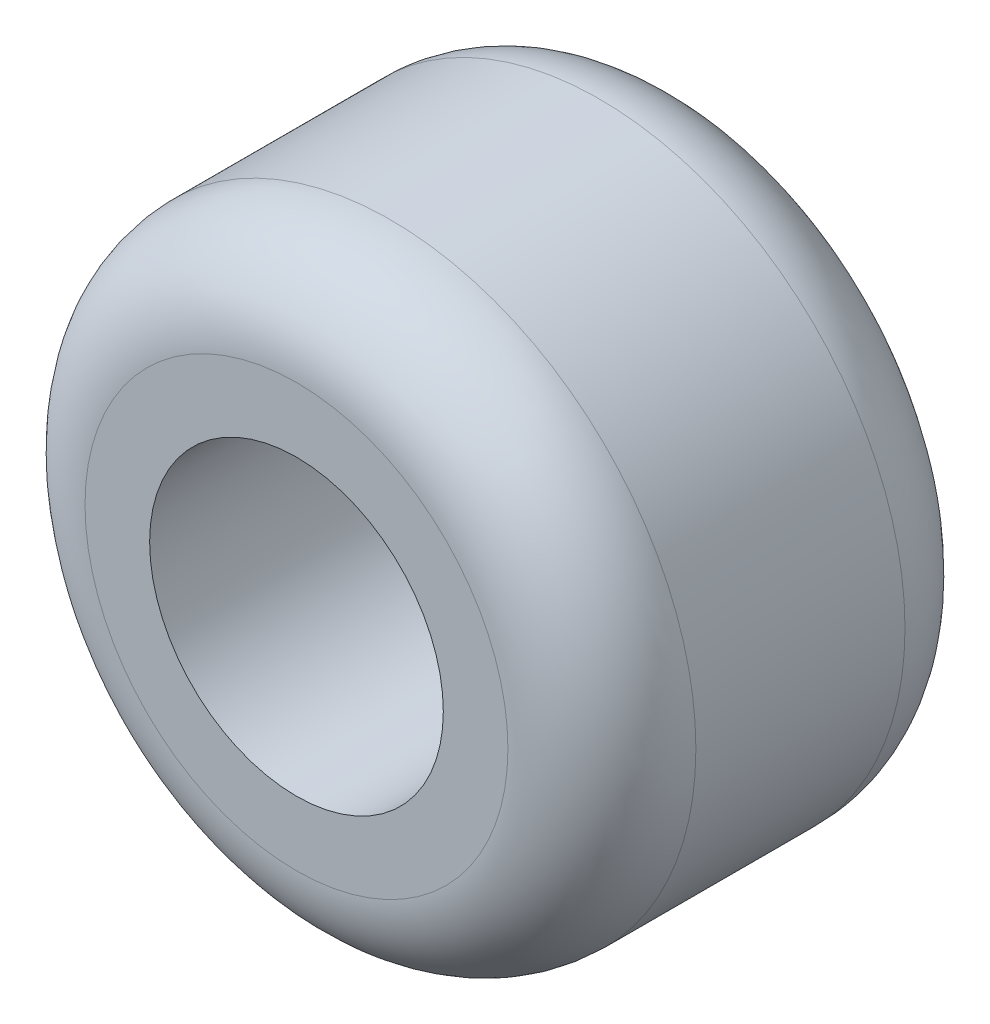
ISO-10303-21;
HEADER;
FILE_DESCRIPTION(('STEP AP214'),'2;1');
FILE_NAME('part.step','',(''),(''),'','','');
FILE_SCHEMA(('AUTOMOTIVE_DESIGN { 1 0 10303 214 1 1 1 1 }'));
ENDSEC;
DATA;
#1=APPLICATION_CONTEXT('core data for automotive mechanical design processes');
#2=APPLICATION_PROTOCOL_DEFINITION('international standard','automotive_design',2000,#1);
#3=PRODUCT_CONTEXT('',#1,'mechanical');
#4=PRODUCT('Part','Part','',(#3));
#5=PRODUCT_RELATED_PRODUCT_CATEGORY('part','',(#4));
#6=PRODUCT_DEFINITION_FORMATION('','',#4);
#7=PRODUCT_DEFINITION_CONTEXT('part definition',#1,'design');
#8=PRODUCT_DEFINITION('design','',#6,#7);
#9=PRODUCT_DEFINITION_SHAPE('','',#8);
#10=(LENGTH_UNIT() NAMED_UNIT(*) SI_UNIT(.MILLI.,.METRE.));
#11=(NAMED_UNIT(*) PLANE_ANGLE_UNIT() SI_UNIT($,.RADIAN.));
#12=(NAMED_UNIT(*) SI_UNIT($,.STERADIAN.) SOLID_ANGLE_UNIT());
#13=UNCERTAINTY_MEASURE_WITH_UNIT(LENGTH_MEASURE(1.E-05),#10,'distance_accuracy_value','');
#14=(GEOMETRIC_REPRESENTATION_CONTEXT(3) GLOBAL_UNCERTAINTY_ASSIGNED_CONTEXT((#13)) GLOBAL_UNIT_ASSIGNED_CONTEXT((#10,
#11,#12)) REPRESENTATION_CONTEXT('',''));
#15=CARTESIAN_POINT('',(0.,0.,0.));
#16=DIRECTION('',(0.,0.,1.));
#17=DIRECTION('',(1.,0.,0.));
#18=AXIS2_PLACEMENT_3D('',#15,#16,#17);
#19=CARTESIAN_POINT('',(0.,0.,169.));
#20=DIRECTION('',(0.,0.,1.));
#21=DIRECTION('',(1.,0.,0.));
#22=AXIS2_PLACEMENT_3D('',#19,#20,#21);
#23=PLANE('',#22);
#24=CARTESIAN_POINT('',(0.,0.,169.));
#25=DIRECTION('',(0.,0.,1.));
#26=DIRECTION('',(1.,0.,0.));
#27=AXIS2_PLACEMENT_3D('',#24,#25,#26);
#28=CIRCLE('',#27,90.);
#29=CARTESIAN_POINT('',(90.,0.,169.));
#30=VERTEX_POINT('',#29);
#31=EDGE_CURVE('E48',#30,#30,#28,.T.);
#32=ORIENTED_EDGE('',*,*,#31,.T.);
#33=EDGE_LOOP('',(#32));
#34=FACE_BOUND('',#33,.T.);
#35=CARTESIAN_POINT('',(0.,0.,169.));
#36=DIRECTION('',(0.,0.,1.));
#37=DIRECTION('',(1.,0.,0.));
#38=AXIS2_PLACEMENT_3D('',#35,#36,#37);
#39=CIRCLE('',#38,62.5);
#40=CARTESIAN_POINT('',(62.5,0.,169.));
#41=VERTEX_POINT('',#40);
#42=EDGE_CURVE('E53',#41,#41,#39,.T.);
#43=ORIENTED_EDGE('',*,*,#42,.F.);
#44=EDGE_LOOP('',(#43));
#45=FACE_BOUND('',#44,.T.);
#46=ADVANCED_FACE('F33',(#34,#45),#23,.T.);
#47=CARTESIAN_POINT('',(0.,0.,0.));
#48=DIRECTION('',(0.,0.,1.));
#49=DIRECTION('',(1.,0.,0.));
#50=AXIS2_PLACEMENT_3D('',#47,#48,#49);
#51=PLANE('',#50);
#52=CARTESIAN_POINT('',(0.,0.,0.));
#53=DIRECTION('',(0.,0.,1.));
#54=DIRECTION('',(1.,0.,0.));
#55=AXIS2_PLACEMENT_3D('',#52,#53,#54);
#56=CIRCLE('',#55,90.);
#57=CARTESIAN_POINT('',(90.,0.,0.));
#58=VERTEX_POINT('',#57);
#59=EDGE_CURVE('E10',#58,#58,#56,.F.);
#60=ORIENTED_EDGE('',*,*,#59,.T.);
#61=EDGE_LOOP('',(#60));
#62=FACE_BOUND('',#61,.T.);
#63=CARTESIAN_POINT('',(0.,0.,0.));
#64=DIRECTION('',(0.,0.,1.));
#65=DIRECTION('',(1.,0.,0.));
#66=AXIS2_PLACEMENT_3D('',#63,#64,#65);
#67=CIRCLE('',#66,62.5);
#68=CARTESIAN_POINT('',(62.5,0.,0.));
#69=VERTEX_POINT('',#68);
#70=EDGE_CURVE('E56',#69,#69,#67,.T.);
#71=ORIENTED_EDGE('',*,*,#70,.T.);
#72=EDGE_LOOP('',(#71));
#73=FACE_BOUND('',#72,.T.);
#74=ADVANCED_FACE('F60',(#62,#73),#51,.F.);
#75=CARTESIAN_POINT('',(0.,0.,169.));
#76=DIRECTION('',(0.,0.,-1.));
#77=DIRECTION('',(-1.,0.,0.));
#78=AXIS2_PLACEMENT_3D('',#75,#76,#77);
#79=CYLINDRICAL_SURFACE('',#78,130.);
#80=CARTESIAN_POINT('',(0.,0.,129.));
#81=DIRECTION('',(0.,0.,1.));
#82=DIRECTION('',(1.,0.,0.));
#83=AXIS2_PLACEMENT_3D('',#80,#81,#82);
#84=CIRCLE('',#83,130.);
#85=CARTESIAN_POINT('',(130.,0.,129.));
#86=VERTEX_POINT('',#85);
#87=EDGE_CURVE('E40',#86,#86,#84,.F.);
#88=ORIENTED_EDGE('',*,*,#87,.T.);
#89=EDGE_LOOP('',(#88));
#90=FACE_BOUND('',#89,.T.);
#91=CARTESIAN_POINT('',(0.,0.,40.));
#92=DIRECTION('',(0.,0.,1.));
#93=DIRECTION('',(1.,0.,0.));
#94=AXIS2_PLACEMENT_3D('',#91,#92,#93);
#95=CIRCLE('',#94,130.);
#96=CARTESIAN_POINT('',(130.,0.,40.));
#97=VERTEX_POINT('',#96);
#98=EDGE_CURVE('E44',#97,#97,#95,.T.);
#99=ORIENTED_EDGE('',*,*,#98,.T.);
#100=EDGE_LOOP('',(#99));
#101=FACE_BOUND('',#100,.T.);
#102=ADVANCED_FACE('F35',(#90,#101),#79,.T.);
#103=CARTESIAN_POINT('',(0.,0.,169.));
#104=DIRECTION('',(0.,0.,-1.));
#105=DIRECTION('',(-1.,0.,0.));
#106=AXIS2_PLACEMENT_3D('',#103,#104,#105);
#107=CYLINDRICAL_SURFACE('',#106,62.5);
#108=ORIENTED_EDGE('',*,*,#42,.T.);
#109=EDGE_LOOP('',(#108));
#110=FACE_BOUND('',#109,.T.);
#111=ORIENTED_EDGE('',*,*,#70,.F.);
#112=EDGE_LOOP('',(#111));
#113=FACE_BOUND('',#112,.T.);
#114=ADVANCED_FACE('F62',(#110,#113),#107,.F.);
#115=CARTESIAN_POINT('',(0.,0.,129.));
#116=DIRECTION('',(0.,0.,1.));
#117=DIRECTION('',(1.,0.,0.));
#118=AXIS2_PLACEMENT_3D('',#115,#116,#117);
#119=TOROIDAL_SURFACE('',#118,90.,40.);
#120=ORIENTED_EDGE('',*,*,#87,.F.);
#121=EDGE_LOOP('',(#120));
#122=FACE_BOUND('',#121,.T.);
#123=ORIENTED_EDGE('',*,*,#31,.F.);
#124=EDGE_LOOP('',(#123));
#125=FACE_BOUND('',#124,.T.);
#126=ADVANCED_FACE('F64',(#122,#125),#119,.T.);
#127=CARTESIAN_POINT('',(0.,0.,40.));
#128=DIRECTION('',(0.,0.,1.));
#129=DIRECTION('',(1.,0.,0.));
#130=AXIS2_PLACEMENT_3D('',#127,#128,#129);
#131=TOROIDAL_SURFACE('',#130,90.,40.);
#132=ORIENTED_EDGE('',*,*,#59,.F.);
#133=EDGE_LOOP('',(#132));
#134=FACE_BOUND('',#133,.T.);
#135=ORIENTED_EDGE('',*,*,#98,.F.);
#136=EDGE_LOOP('',(#135));
#137=FACE_BOUND('',#136,.T.);
#138=ADVANCED_FACE('F71',(#134,#137),#131,.T.);
#139=CLOSED_SHELL('',(#46,#74,#102,#114,#126,#138));
#140=MANIFOLD_SOLID_BREP('B2',#139);
#141=ADVANCED_BREP_SHAPE_REPRESENTATION('',(#18,#140),#14);
#142=SHAPE_DEFINITION_REPRESENTATION(#9,#141);
ENDSEC;
END-ISO-10303-21;
